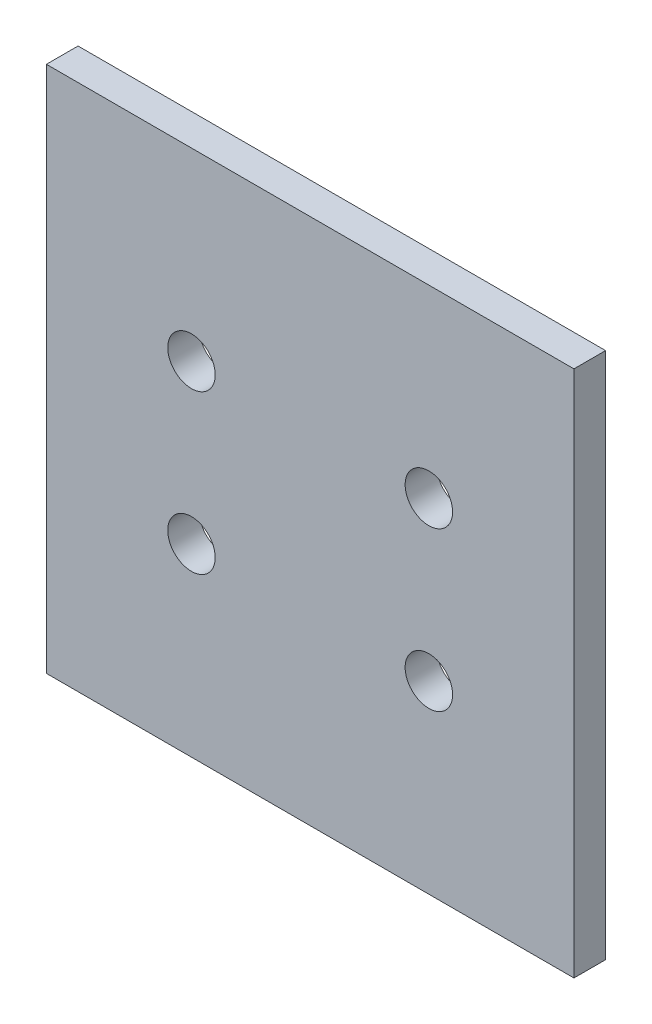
ISO-10303-21;
HEADER;
FILE_DESCRIPTION(('STEP AP214'),'2;1');
FILE_NAME('part.step','',(''),(''),'','','');
FILE_SCHEMA(('AUTOMOTIVE_DESIGN { 1 0 10303 214 1 1 1 1 }'));
ENDSEC;
DATA;
#1=APPLICATION_CONTEXT('core data for automotive mechanical design processes');
#2=APPLICATION_PROTOCOL_DEFINITION('international standard','automotive_design',2000,#1);
#3=PRODUCT_CONTEXT('',#1,'mechanical');
#4=PRODUCT('Part','Part','',(#3));
#5=PRODUCT_RELATED_PRODUCT_CATEGORY('part','',(#4));
#6=PRODUCT_DEFINITION_FORMATION('','',#4);
#7=PRODUCT_DEFINITION_CONTEXT('part definition',#1,'design');
#8=PRODUCT_DEFINITION('design','',#6,#7);
#9=PRODUCT_DEFINITION_SHAPE('','',#8);
#10=(LENGTH_UNIT() NAMED_UNIT(*) SI_UNIT(.MILLI.,.METRE.));
#11=(NAMED_UNIT(*) PLANE_ANGLE_UNIT() SI_UNIT($,.RADIAN.));
#12=(NAMED_UNIT(*) SI_UNIT($,.STERADIAN.) SOLID_ANGLE_UNIT());
#13=UNCERTAINTY_MEASURE_WITH_UNIT(LENGTH_MEASURE(1.E-05),#10,'distance_accuracy_value','');
#14=(GEOMETRIC_REPRESENTATION_CONTEXT(3) GLOBAL_UNCERTAINTY_ASSIGNED_CONTEXT((#13)) GLOBAL_UNIT_ASSIGNED_CONTEXT((#10,
#11,#12)) REPRESENTATION_CONTEXT('',''));
#15=CARTESIAN_POINT('',(0.,0.,0.));
#16=DIRECTION('',(0.,0.,1.));
#17=DIRECTION('',(1.,0.,0.));
#18=AXIS2_PLACEMENT_3D('',#15,#16,#17);
#19=CARTESIAN_POINT('',(0.,0.,12.));
#20=DIRECTION('',(0.,0.,1.));
#21=DIRECTION('',(1.,0.,0.));
#22=AXIS2_PLACEMENT_3D('',#19,#20,#21);
#23=PLANE('',#22);
#24=CARTESIAN_POINT('',(45.,30.,12.));
#25=DIRECTION('',(0.,0.,1.));
#26=DIRECTION('',(1.,0.,0.));
#27=AXIS2_PLACEMENT_3D('',#24,#25,#26);
#28=CIRCLE('',#27,9.);
#29=CARTESIAN_POINT('',(54.,30.,12.));
#30=VERTEX_POINT('',#29);
#31=EDGE_CURVE('E25',#30,#30,#28,.T.);
#32=ORIENTED_EDGE('',*,*,#31,.F.);
#33=EDGE_LOOP('',(#32));
#34=FACE_BOUND('',#33,.T.);
#35=CARTESIAN_POINT('',(45.,-30.,12.));
#36=DIRECTION('',(0.,0.,1.));
#37=DIRECTION('',(1.,0.,0.));
#38=AXIS2_PLACEMENT_3D('',#35,#36,#37);
#39=CIRCLE('',#38,9.);
#40=CARTESIAN_POINT('',(54.,-30.,12.));
#41=VERTEX_POINT('',#40);
#42=EDGE_CURVE('E112',#41,#41,#39,.T.);
#43=ORIENTED_EDGE('',*,*,#42,.F.);
#44=EDGE_LOOP('',(#43));
#45=FACE_BOUND('',#44,.T.);
#46=CARTESIAN_POINT('',(-45.,30.,12.));
#47=DIRECTION('',(0.,0.,1.));
#48=DIRECTION('',(1.,0.,0.));
#49=AXIS2_PLACEMENT_3D('',#46,#47,#48);
#50=CIRCLE('',#49,9.);
#51=CARTESIAN_POINT('',(-36.,30.,12.));
#52=VERTEX_POINT('',#51);
#53=EDGE_CURVE('E89',#52,#52,#50,.T.);
#54=ORIENTED_EDGE('',*,*,#53,.F.);
#55=EDGE_LOOP('',(#54));
#56=FACE_BOUND('',#55,.T.);
#57=CARTESIAN_POINT('',(-45.,-30.,12.));
#58=DIRECTION('',(0.,0.,1.));
#59=DIRECTION('',(1.,0.,0.));
#60=AXIS2_PLACEMENT_3D('',#57,#58,#59);
#61=CIRCLE('',#60,9.);
#62=CARTESIAN_POINT('',(-36.,-30.,12.));
#63=VERTEX_POINT('',#62);
#64=EDGE_CURVE('E255',#63,#63,#61,.T.);
#65=ORIENTED_EDGE('',*,*,#64,.F.);
#66=EDGE_LOOP('',(#65));
#67=FACE_BOUND('',#66,.T.);
#68=DIRECTION('',(1.,0.,0.));
#69=VECTOR('',#68,1.);
#70=CARTESIAN_POINT('',(-100.,-100.,12.));
#71=LINE('',#70,#69);
#72=CARTESIAN_POINT('',(-100.,-100.,12.));
#73=VERTEX_POINT('',#72);
#74=CARTESIAN_POINT('',(100.,-100.,12.));
#75=VERTEX_POINT('',#74);
#76=EDGE_CURVE('E243',#73,#75,#71,.T.);
#77=ORIENTED_EDGE('',*,*,#76,.T.);
#78=DIRECTION('',(0.,1.,0.));
#79=VECTOR('',#78,1.);
#80=CARTESIAN_POINT('',(100.,-100.,12.));
#81=LINE('',#80,#79);
#82=CARTESIAN_POINT('',(100.,100.,12.));
#83=VERTEX_POINT('',#82);
#84=EDGE_CURVE('E239',#75,#83,#81,.T.);
#85=ORIENTED_EDGE('',*,*,#84,.T.);
#86=DIRECTION('',(-1.,0.,0.));
#87=VECTOR('',#86,1.);
#88=CARTESIAN_POINT('',(100.,100.,12.));
#89=LINE('',#88,#87);
#90=CARTESIAN_POINT('',(-100.,100.,12.));
#91=VERTEX_POINT('',#90);
#92=EDGE_CURVE('E267',#83,#91,#89,.T.);
#93=ORIENTED_EDGE('',*,*,#92,.T.);
#94=DIRECTION('',(0.,-1.,0.));
#95=VECTOR('',#94,1.);
#96=CARTESIAN_POINT('',(-100.,100.,12.));
#97=LINE('',#96,#95);
#98=EDGE_CURVE('E276',#91,#73,#97,.T.);
#99=ORIENTED_EDGE('',*,*,#98,.T.);
#100=EDGE_LOOP('',(#77,#85,#93,#99));
#101=FACE_BOUND('',#100,.T.);
#102=ADVANCED_FACE('F16',(#34,#45,#56,#67,#101),#23,.T.);
#103=CARTESIAN_POINT('',(0.,0.,0.));
#104=DIRECTION('',(0.,0.,1.));
#105=DIRECTION('',(1.,0.,0.));
#106=AXIS2_PLACEMENT_3D('',#103,#104,#105);
#107=PLANE('',#106);
#108=CARTESIAN_POINT('',(45.,30.,0.));
#109=DIRECTION('',(0.,0.,1.));
#110=DIRECTION('',(1.,0.,0.));
#111=AXIS2_PLACEMENT_3D('',#108,#109,#110);
#112=CIRCLE('',#111,9.);
#113=CARTESIAN_POINT('',(54.,30.,0.));
#114=VERTEX_POINT('',#113);
#115=EDGE_CURVE('E10',#114,#114,#112,.T.);
#116=ORIENTED_EDGE('',*,*,#115,.T.);
#117=EDGE_LOOP('',(#116));
#118=FACE_BOUND('',#117,.T.);
#119=CARTESIAN_POINT('',(45.,-30.,0.));
#120=DIRECTION('',(0.,0.,1.));
#121=DIRECTION('',(1.,0.,0.));
#122=AXIS2_PLACEMENT_3D('',#119,#120,#121);
#123=CIRCLE('',#122,9.);
#124=CARTESIAN_POINT('',(54.,-30.,0.));
#125=VERTEX_POINT('',#124);
#126=EDGE_CURVE('E116',#125,#125,#123,.T.);
#127=ORIENTED_EDGE('',*,*,#126,.T.);
#128=EDGE_LOOP('',(#127));
#129=FACE_BOUND('',#128,.T.);
#130=CARTESIAN_POINT('',(-45.,30.,0.));
#131=DIRECTION('',(0.,0.,1.));
#132=DIRECTION('',(1.,0.,0.));
#133=AXIS2_PLACEMENT_3D('',#130,#131,#132);
#134=CIRCLE('',#133,9.);
#135=CARTESIAN_POINT('',(-36.,30.,0.));
#136=VERTEX_POINT('',#135);
#137=EDGE_CURVE('E95',#136,#136,#134,.T.);
#138=ORIENTED_EDGE('',*,*,#137,.T.);
#139=EDGE_LOOP('',(#138));
#140=FACE_BOUND('',#139,.T.);
#141=CARTESIAN_POINT('',(-45.,-30.,0.));
#142=DIRECTION('',(0.,0.,1.));
#143=DIRECTION('',(1.,0.,0.));
#144=AXIS2_PLACEMENT_3D('',#141,#142,#143);
#145=CIRCLE('',#144,9.);
#146=CARTESIAN_POINT('',(-36.,-30.,0.));
#147=VERTEX_POINT('',#146);
#148=EDGE_CURVE('E103',#147,#147,#145,.T.);
#149=ORIENTED_EDGE('',*,*,#148,.T.);
#150=EDGE_LOOP('',(#149));
#151=FACE_BOUND('',#150,.T.);
#152=DIRECTION('',(0.,-1.,0.));
#153=VECTOR('',#152,1.);
#154=CARTESIAN_POINT('',(-100.,100.,0.));
#155=LINE('',#154,#153);
#156=CARTESIAN_POINT('',(-100.,100.,0.));
#157=VERTEX_POINT('',#156);
#158=CARTESIAN_POINT('',(-100.,-100.,0.));
#159=VERTEX_POINT('',#158);
#160=EDGE_CURVE('E271',#157,#159,#155,.T.);
#161=ORIENTED_EDGE('',*,*,#160,.F.);
#162=DIRECTION('',(-1.,0.,0.));
#163=VECTOR('',#162,1.);
#164=CARTESIAN_POINT('',(100.,100.,0.));
#165=LINE('',#164,#163);
#166=CARTESIAN_POINT('',(100.,100.,0.));
#167=VERTEX_POINT('',#166);
#168=EDGE_CURVE('E229',#167,#157,#165,.T.);
#169=ORIENTED_EDGE('',*,*,#168,.F.);
#170=DIRECTION('',(0.,1.,0.));
#171=VECTOR('',#170,1.);
#172=CARTESIAN_POINT('',(100.,-100.,0.));
#173=LINE('',#172,#171);
#174=CARTESIAN_POINT('',(100.,-100.,0.));
#175=VERTEX_POINT('',#174);
#176=EDGE_CURVE('E224',#175,#167,#173,.T.);
#177=ORIENTED_EDGE('',*,*,#176,.F.);
#178=DIRECTION('',(1.,0.,0.));
#179=VECTOR('',#178,1.);
#180=CARTESIAN_POINT('',(-100.,-100.,0.));
#181=LINE('',#180,#179);
#182=EDGE_CURVE('E227',#159,#175,#181,.T.);
#183=ORIENTED_EDGE('',*,*,#182,.F.);
#184=EDGE_LOOP('',(#161,#169,#177,#183));
#185=FACE_BOUND('',#184,.T.);
#186=ADVANCED_FACE('F128',(#118,#129,#140,#151,#185),#107,.F.);
#187=CARTESIAN_POINT('',(45.,30.,0.));
#188=DIRECTION('',(0.,0.,-1.));
#189=DIRECTION('',(1.,0.,0.));
#190=AXIS2_PLACEMENT_3D('',#187,#188,#189);
#191=CYLINDRICAL_SURFACE('',#190,9.);
#192=DIRECTION('',(0.,0.,1.));
#193=VECTOR('',#192,1.);
#194=CARTESIAN_POINT('',(54.,30.,0.));
#195=LINE('',#194,#193);
#196=EDGE_CURVE('E119',#114,#30,#195,.T.);
#197=ORIENTED_EDGE('',*,*,#196,.T.);
#198=ORIENTED_EDGE('',*,*,#31,.T.);
#199=ORIENTED_EDGE('',*,*,#196,.F.);
#200=ORIENTED_EDGE('',*,*,#115,.F.);
#201=EDGE_LOOP('',(#197,#198,#199,#200));
#202=FACE_BOUND('',#201,.T.);
#203=ADVANCED_FACE('F133',(#202),#191,.F.);
#204=CARTESIAN_POINT('',(45.,-30.,0.));
#205=DIRECTION('',(0.,0.,-1.));
#206=DIRECTION('',(1.,0.,0.));
#207=AXIS2_PLACEMENT_3D('',#204,#205,#206);
#208=CYLINDRICAL_SURFACE('',#207,9.);
#209=DIRECTION('',(0.,0.,1.));
#210=VECTOR('',#209,1.);
#211=CARTESIAN_POINT('',(54.,-30.,0.));
#212=LINE('',#211,#210);
#213=EDGE_CURVE('E100',#125,#41,#212,.T.);
#214=ORIENTED_EDGE('',*,*,#213,.T.);
#215=ORIENTED_EDGE('',*,*,#42,.T.);
#216=ORIENTED_EDGE('',*,*,#213,.F.);
#217=ORIENTED_EDGE('',*,*,#126,.F.);
#218=EDGE_LOOP('',(#214,#215,#216,#217));
#219=FACE_BOUND('',#218,.T.);
#220=ADVANCED_FACE('F161',(#219),#208,.F.);
#221=CARTESIAN_POINT('',(-45.,30.,0.));
#222=DIRECTION('',(0.,0.,-1.));
#223=DIRECTION('',(1.,0.,0.));
#224=AXIS2_PLACEMENT_3D('',#221,#222,#223);
#225=CYLINDRICAL_SURFACE('',#224,9.);
#226=DIRECTION('',(0.,0.,1.));
#227=VECTOR('',#226,1.);
#228=CARTESIAN_POINT('',(-36.,30.,0.));
#229=LINE('',#228,#227);
#230=EDGE_CURVE('E92',#136,#52,#229,.T.);
#231=ORIENTED_EDGE('',*,*,#230,.T.);
#232=ORIENTED_EDGE('',*,*,#53,.T.);
#233=ORIENTED_EDGE('',*,*,#230,.F.);
#234=ORIENTED_EDGE('',*,*,#137,.F.);
#235=EDGE_LOOP('',(#231,#232,#233,#234));
#236=FACE_BOUND('',#235,.T.);
#237=ADVANCED_FACE('F90',(#236),#225,.F.);
#238=CARTESIAN_POINT('',(-45.,-30.,0.));
#239=DIRECTION('',(0.,0.,-1.));
#240=DIRECTION('',(1.,0.,0.));
#241=AXIS2_PLACEMENT_3D('',#238,#239,#240);
#242=CYLINDRICAL_SURFACE('',#241,9.);
#243=DIRECTION('',(0.,0.,1.));
#244=VECTOR('',#243,1.);
#245=CARTESIAN_POINT('',(-36.,-30.,0.));
#246=LINE('',#245,#244);
#247=EDGE_CURVE('E106',#147,#63,#246,.T.);
#248=ORIENTED_EDGE('',*,*,#247,.T.);
#249=ORIENTED_EDGE('',*,*,#64,.T.);
#250=ORIENTED_EDGE('',*,*,#247,.F.);
#251=ORIENTED_EDGE('',*,*,#148,.F.);
#252=EDGE_LOOP('',(#248,#249,#250,#251));
#253=FACE_BOUND('',#252,.T.);
#254=ADVANCED_FACE('F183',(#253),#242,.F.);
#255=CARTESIAN_POINT('',(-100.,100.,0.));
#256=DIRECTION('',(1.,0.,0.));
#257=DIRECTION('',(0.,1.,0.));
#258=AXIS2_PLACEMENT_3D('',#255,#256,#257);
#259=PLANE('',#258);
#260=ORIENTED_EDGE('',*,*,#160,.T.);
#261=DIRECTION('',(0.,0.,1.));
#262=VECTOR('',#261,1.);
#263=CARTESIAN_POINT('',(-100.,-100.,0.));
#264=LINE('',#263,#262);
#265=EDGE_CURVE('E234',#159,#73,#264,.T.);
#266=ORIENTED_EDGE('',*,*,#265,.T.);
#267=ORIENTED_EDGE('',*,*,#98,.F.);
#268=DIRECTION('',(0.,0.,1.));
#269=VECTOR('',#268,1.);
#270=CARTESIAN_POINT('',(-100.,100.,0.));
#271=LINE('',#270,#269);
#272=EDGE_CURVE('E266',#157,#91,#271,.T.);
#273=ORIENTED_EDGE('',*,*,#272,.F.);
#274=EDGE_LOOP('',(#260,#266,#267,#273));
#275=FACE_BOUND('',#274,.T.);
#276=ADVANCED_FACE('F174',(#275),#259,.F.);
#277=CARTESIAN_POINT('',(100.,100.,0.));
#278=DIRECTION('',(0.,-1.,0.));
#279=DIRECTION('',(0.,0.,-1.));
#280=AXIS2_PLACEMENT_3D('',#277,#278,#279);
#281=PLANE('',#280);
#282=ORIENTED_EDGE('',*,*,#168,.T.);
#283=ORIENTED_EDGE('',*,*,#272,.T.);
#284=ORIENTED_EDGE('',*,*,#92,.F.);
#285=DIRECTION('',(0.,0.,1.));
#286=VECTOR('',#285,1.);
#287=CARTESIAN_POINT('',(100.,100.,0.));
#288=LINE('',#287,#286);
#289=EDGE_CURVE('E233',#167,#83,#288,.T.);
#290=ORIENTED_EDGE('',*,*,#289,.F.);
#291=EDGE_LOOP('',(#282,#283,#284,#290));
#292=FACE_BOUND('',#291,.T.);
#293=ADVANCED_FACE('F155',(#292),#281,.F.);
#294=CARTESIAN_POINT('',(100.,-100.,0.));
#295=DIRECTION('',(-1.,0.,0.));
#296=DIRECTION('',(0.,0.,1.));
#297=AXIS2_PLACEMENT_3D('',#294,#295,#296);
#298=PLANE('',#297);
#299=ORIENTED_EDGE('',*,*,#176,.T.);
#300=ORIENTED_EDGE('',*,*,#289,.T.);
#301=ORIENTED_EDGE('',*,*,#84,.F.);
#302=DIRECTION('',(0.,0.,1.));
#303=VECTOR('',#302,1.);
#304=CARTESIAN_POINT('',(100.,-100.,0.));
#305=LINE('',#304,#303);
#306=EDGE_CURVE('E237',#175,#75,#305,.T.);
#307=ORIENTED_EDGE('',*,*,#306,.F.);
#308=EDGE_LOOP('',(#299,#300,#301,#307));
#309=FACE_BOUND('',#308,.T.);
#310=ADVANCED_FACE('F146',(#309),#298,.F.);
#311=CARTESIAN_POINT('',(-100.,-100.,0.));
#312=DIRECTION('',(0.,1.,0.));
#313=DIRECTION('',(1.,0.,0.));
#314=AXIS2_PLACEMENT_3D('',#311,#312,#313);
#315=PLANE('',#314);
#316=ORIENTED_EDGE('',*,*,#182,.T.);
#317=ORIENTED_EDGE('',*,*,#306,.T.);
#318=ORIENTED_EDGE('',*,*,#76,.F.);
#319=ORIENTED_EDGE('',*,*,#265,.F.);
#320=EDGE_LOOP('',(#316,#317,#318,#319));
#321=FACE_BOUND('',#320,.T.);
#322=ADVANCED_FACE('F141',(#321),#315,.F.);
#323=CLOSED_SHELL('',(#102,#186,#203,#220,#237,#254,#276,#293,#310,#322));
#324=MANIFOLD_SOLID_BREP('B1',#323);
#325=ADVANCED_BREP_SHAPE_REPRESENTATION('',(#18,#324),#14);
#326=SHAPE_DEFINITION_REPRESENTATION(#9,#325);
ENDSEC;
END-ISO-10303-21;
